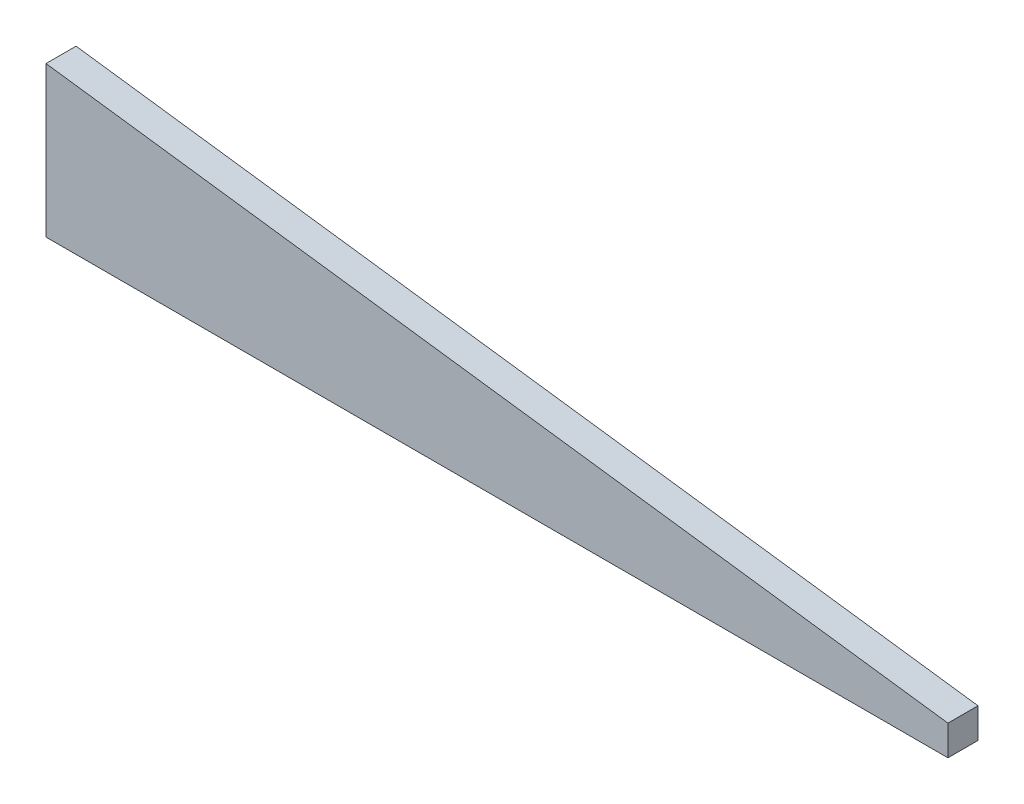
from build123d import *

# Parameters (mm, degrees)
BOSS_EXTRU_1_DEPTH = 10


with BuildPart() as part:
    # Esquisse1 → Boss.-Extru.1 (new body)
    with BuildSketch(Plane.XY):
        Polygon((0, 0), (300, 0), (300, 10), (0, 50), align=None)
    extrude(amount=BOSS_EXTRU_1_DEPTH)


solid = part.part
